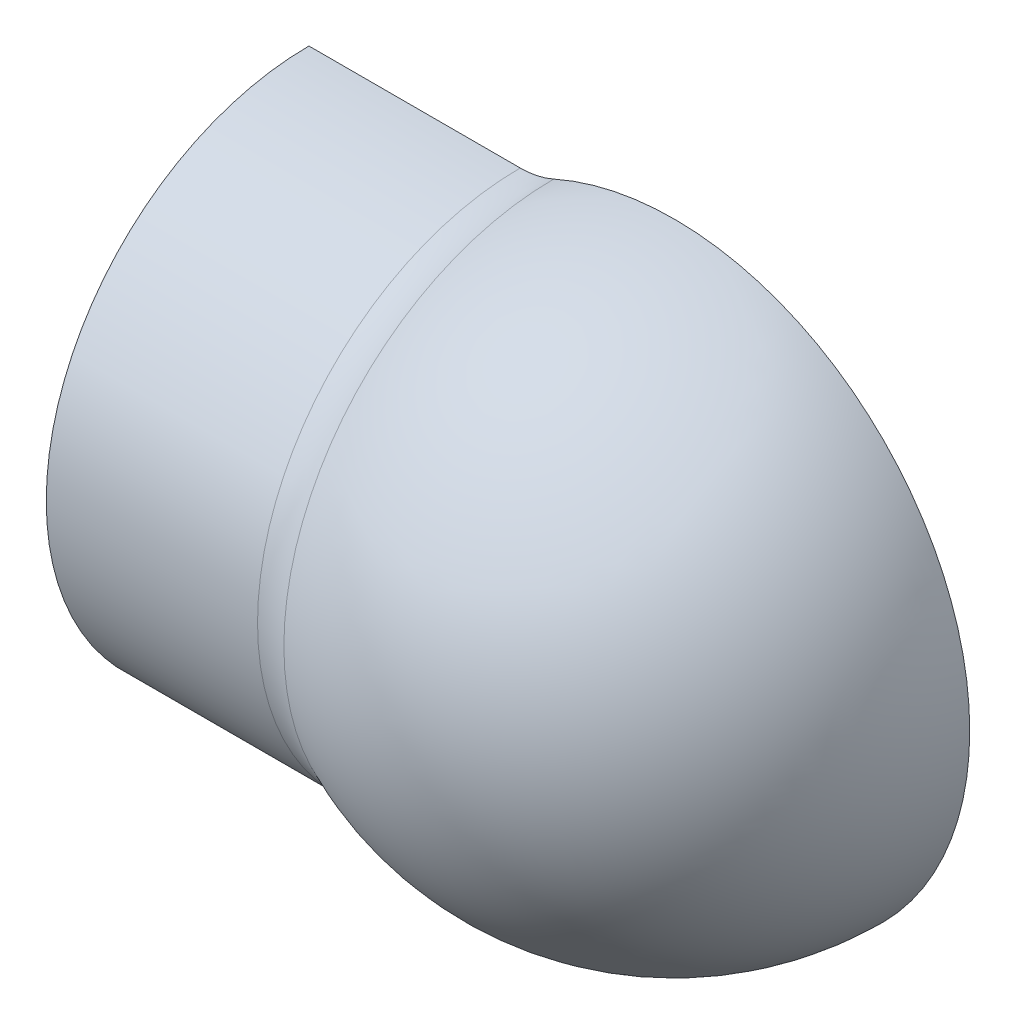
ISO-10303-21;
HEADER;
FILE_DESCRIPTION(('STEP AP214'),'2;1');
FILE_NAME('part.step','',(''),(''),'','','');
FILE_SCHEMA(('AUTOMOTIVE_DESIGN { 1 0 10303 214 1 1 1 1 }'));
ENDSEC;
DATA;
#1=APPLICATION_CONTEXT('core data for automotive mechanical design processes');
#2=APPLICATION_PROTOCOL_DEFINITION('international standard','automotive_design',2000,#1);
#3=PRODUCT_CONTEXT('',#1,'mechanical');
#4=PRODUCT('Part','Part','',(#3));
#5=PRODUCT_RELATED_PRODUCT_CATEGORY('part','',(#4));
#6=PRODUCT_DEFINITION_FORMATION('','',#4);
#7=PRODUCT_DEFINITION_CONTEXT('part definition',#1,'design');
#8=PRODUCT_DEFINITION('design','',#6,#7);
#9=PRODUCT_DEFINITION_SHAPE('','',#8);
#10=(LENGTH_UNIT() NAMED_UNIT(*) SI_UNIT(.MILLI.,.METRE.));
#11=(NAMED_UNIT(*) PLANE_ANGLE_UNIT() SI_UNIT($,.RADIAN.));
#12=(NAMED_UNIT(*) SI_UNIT($,.STERADIAN.) SOLID_ANGLE_UNIT());
#13=UNCERTAINTY_MEASURE_WITH_UNIT(LENGTH_MEASURE(1.E-05),#10,'distance_accuracy_value','');
#14=(GEOMETRIC_REPRESENTATION_CONTEXT(3) GLOBAL_UNCERTAINTY_ASSIGNED_CONTEXT((#13)) GLOBAL_UNIT_ASSIGNED_CONTEXT((#10,
#11,#12)) REPRESENTATION_CONTEXT('',''));
#15=CARTESIAN_POINT('',(0.,0.,0.));
#16=DIRECTION('',(0.,0.,1.));
#17=DIRECTION('',(1.,0.,0.));
#18=AXIS2_PLACEMENT_3D('',#15,#16,#17);
#19=CARTESIAN_POINT('',(0.,0.,0.));
#20=DIRECTION('',(-1.,0.,0.));
#21=DIRECTION('',(0.,-1.,0.));
#22=AXIS2_PLACEMENT_3D('',#19,#20,#21);
#23=SPHERICAL_SURFACE('',#22,36.);
#24=CARTESIAN_POINT('',(0.,0.,0.));
#25=DIRECTION('',(0.,0.,-1.));
#26=DIRECTION('',(1.,0.,0.));
#27=AXIS2_PLACEMENT_3D('',#24,#25,#26);
#28=CIRCLE('',#27,36.);
#29=CARTESIAN_POINT('',(-14.6830406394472,32.8695652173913,9.00989832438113E-13));
#30=VERTEX_POINT('',#29);
#31=CARTESIAN_POINT('',(-14.6830406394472,-32.8695652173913,-9.00989832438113E-13));
#32=VERTEX_POINT('',#31);
#33=EDGE_CURVE('E104',#30,#32,#28,.T.);
#34=ORIENTED_EDGE('',*,*,#33,.F.);
#35=CARTESIAN_POINT('',(-14.6830406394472,0.,0.));
#36=DIRECTION('',(1.,0.,0.));
#37=DIRECTION('',(0.,0.,-1.));
#38=AXIS2_PLACEMENT_3D('',#35,#36,#37);
#39=CIRCLE('',#38,32.8695652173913);
#40=EDGE_CURVE('E52',#30,#32,#39,.T.);
#41=ORIENTED_EDGE('',*,*,#40,.T.);
#42=EDGE_LOOP('',(#34,#41));
#43=FACE_BOUND('',#42,.T.);
#44=ADVANCED_FACE('F31',(#43),#23,.T.);
#45=CARTESIAN_POINT('',(-44.5,0.,0.));
#46=DIRECTION('',(-1.,0.,0.));
#47=DIRECTION('',(0.,0.,1.));
#48=AXIS2_PLACEMENT_3D('',#45,#46,#47);
#49=CYLINDRICAL_SURFACE('',#48,32.);
#50=DIRECTION('',(-1.,0.,0.));
#51=VECTOR('',#50,1.);
#52=CARTESIAN_POINT('',(-44.5,-32.,-8.77154122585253E-13));
#53=LINE('',#52,#51);
#54=CARTESIAN_POINT('',(-18.7616630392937,-32.,-8.77154122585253E-13));
#55=VERTEX_POINT('',#54);
#56=CARTESIAN_POINT('',(-44.5,-32.,-8.77154122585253E-13));
#57=VERTEX_POINT('',#56);
#58=EDGE_CURVE('E116',#55,#57,#53,.T.);
#59=ORIENTED_EDGE('',*,*,#58,.F.);
#60=CARTESIAN_POINT('',(-18.7616630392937,0.,0.));
#61=DIRECTION('',(1.,0.,0.));
#62=DIRECTION('',(0.,0.,-1.));
#63=AXIS2_PLACEMENT_3D('',#60,#61,#62);
#64=CIRCLE('',#63,32.);
#65=CARTESIAN_POINT('',(-18.7616630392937,32.,0.));
#66=VERTEX_POINT('',#65);
#67=EDGE_CURVE('E124',#55,#66,#64,.F.);
#68=ORIENTED_EDGE('',*,*,#67,.T.);
#69=DIRECTION('',(-1.,0.,0.));
#70=VECTOR('',#69,1.);
#71=CARTESIAN_POINT('',(-44.5,32.,0.));
#72=LINE('',#71,#70);
#73=CARTESIAN_POINT('',(-44.5,32.,0.));
#74=VERTEX_POINT('',#73);
#75=EDGE_CURVE('E102',#66,#74,#72,.T.);
#76=ORIENTED_EDGE('',*,*,#75,.T.);
#77=CARTESIAN_POINT('',(-44.5,0.,0.));
#78=DIRECTION('',(-1.,0.,0.));
#79=DIRECTION('',(0.,0.,1.));
#80=AXIS2_PLACEMENT_3D('',#77,#78,#79);
#81=CIRCLE('',#80,32.);
#82=EDGE_CURVE('E121',#57,#74,#81,.T.);
#83=ORIENTED_EDGE('',*,*,#82,.F.);
#84=EDGE_LOOP('',(#59,#68,#76,#83));
#85=FACE_BOUND('',#84,.T.);
#86=ADVANCED_FACE('F135',(#85),#49,.T.);
#87=CARTESIAN_POINT('',(-44.5,0.,0.));
#88=DIRECTION('',(1.,0.,0.));
#89=DIRECTION('',(0.,0.,-1.));
#90=AXIS2_PLACEMENT_3D('',#87,#88,#89);
#91=PLANE('',#90);
#92=DIRECTION('',(0.,1.,0.));
#93=VECTOR('',#92,1.);
#94=CARTESIAN_POINT('',(-44.5,0.,0.));
#95=LINE('',#94,#93);
#96=EDGE_CURVE('E118',#57,#74,#95,.T.);
#97=ORIENTED_EDGE('',*,*,#96,.F.);
#98=ORIENTED_EDGE('',*,*,#82,.T.);
#99=EDGE_LOOP('',(#97,#98));
#100=FACE_BOUND('',#99,.T.);
#101=ADVANCED_FACE('F138',(#100),#91,.F.);
#102=CARTESIAN_POINT('',(0.,0.,0.));
#103=DIRECTION('',(0.,0.,-1.));
#104=DIRECTION('',(1.,0.,0.));
#105=AXIS2_PLACEMENT_3D('',#102,#103,#104);
#106=PLANE('',#105);
#107=DIRECTION('',(0.,1.,0.));
#108=VECTOR('',#107,1.);
#109=CARTESIAN_POINT('',(-41.5,0.,0.));
#110=LINE('',#109,#108);
#111=CARTESIAN_POINT('',(-41.5,-29.,-7.94920923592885E-13));
#112=VERTEX_POINT('',#111);
#113=CARTESIAN_POINT('',(-41.5,29.,7.94920923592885E-13));
#114=VERTEX_POINT('',#113);
#115=EDGE_CURVE('E110',#112,#114,#110,.T.);
#116=ORIENTED_EDGE('',*,*,#115,.F.);
#117=DIRECTION('',(-1.,0.,0.));
#118=VECTOR('',#117,1.);
#119=CARTESIAN_POINT('',(-18.7616630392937,-29.,-8.03799612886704E-13));
#120=LINE('',#119,#118);
#121=CARTESIAN_POINT('',(-18.7616630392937,-29.,-8.03799612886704E-13));
#122=VERTEX_POINT('',#121);
#123=EDGE_CURVE('E96',#122,#112,#120,.T.);
#124=ORIENTED_EDGE('',*,*,#123,.F.);
#125=CARTESIAN_POINT('',(-18.7616630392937,-42.,-1.15126478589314E-12));
#126=DIRECTION('',(0.,0.,-1.));
#127=DIRECTION('',(0.,1.,0.));
#128=AXIS2_PLACEMENT_3D('',#125,#126,#127);
#129=CIRCLE('',#128,13.);
#130=CARTESIAN_POINT('',(-13.4594539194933,-30.1304347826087,-8.25907346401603E-13));
#131=VERTEX_POINT('',#130);
#132=EDGE_CURVE('E86',#131,#122,#129,.F.);
#133=ORIENTED_EDGE('',*,*,#132,.F.);
#134=CARTESIAN_POINT('',(0.,0.,0.));
#135=DIRECTION('',(0.,0.,-1.));
#136=DIRECTION('',(0.,1.,0.));
#137=AXIS2_PLACEMENT_3D('',#134,#135,#136);
#138=CIRCLE('',#137,33.);
#139=CARTESIAN_POINT('',(-13.4594539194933,30.1304347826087,8.29597260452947E-13));
#140=VERTEX_POINT('',#139);
#141=EDGE_CURVE('E93',#140,#131,#138,.T.);
#142=ORIENTED_EDGE('',*,*,#141,.F.);
#143=CARTESIAN_POINT('',(-18.7616630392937,42.,1.15126478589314E-12));
#144=DIRECTION('',(0.,0.,-1.));
#145=DIRECTION('',(0.,1.,0.));
#146=AXIS2_PLACEMENT_3D('',#143,#144,#145);
#147=CIRCLE('',#146,13.);
#148=CARTESIAN_POINT('',(-18.7616630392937,29.,0.));
#149=VERTEX_POINT('',#148);
#150=EDGE_CURVE('E89',#149,#140,#147,.F.);
#151=ORIENTED_EDGE('',*,*,#150,.F.);
#152=DIRECTION('',(-1.,0.,0.));
#153=VECTOR('',#152,1.);
#154=CARTESIAN_POINT('',(-18.7616630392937,29.,0.));
#155=LINE('',#154,#153);
#156=EDGE_CURVE('E97',#149,#114,#155,.T.);
#157=ORIENTED_EDGE('',*,*,#156,.T.);
#158=EDGE_LOOP('',(#116,#124,#133,#142,#151,#157));
#159=FACE_BOUND('',#158,.T.);
#160=ORIENTED_EDGE('',*,*,#96,.T.);
#161=ORIENTED_EDGE('',*,*,#75,.F.);
#162=CARTESIAN_POINT('',(-18.7616630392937,42.,1.15126478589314E-12));
#163=DIRECTION('',(0.,0.,-1.));
#164=DIRECTION('',(0.,1.,0.));
#165=AXIS2_PLACEMENT_3D('',#162,#163,#164);
#166=CIRCLE('',#165,10.);
#167=EDGE_CURVE('E38',#66,#30,#166,.F.);
#168=ORIENTED_EDGE('',*,*,#167,.T.);
#169=ORIENTED_EDGE('',*,*,#33,.T.);
#170=CARTESIAN_POINT('',(-18.7616630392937,-42.,-1.15126478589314E-12));
#171=DIRECTION('',(0.,0.,-1.));
#172=DIRECTION('',(0.,1.,0.));
#173=AXIS2_PLACEMENT_3D('',#170,#171,#172);
#174=CIRCLE('',#173,10.);
#175=EDGE_CURVE('E11',#32,#55,#174,.F.);
#176=ORIENTED_EDGE('',*,*,#175,.T.);
#177=ORIENTED_EDGE('',*,*,#58,.T.);
#178=EDGE_LOOP('',(#160,#161,#168,#169,#176,#177));
#179=FACE_BOUND('',#178,.T.);
#180=ADVANCED_FACE('F100',(#159,#179),#106,.T.);
#181=CARTESIAN_POINT('',(-18.7616630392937,0.,0.));
#182=DIRECTION('',(1.,0.,0.));
#183=DIRECTION('',(0.,0.,-1.));
#184=AXIS2_PLACEMENT_3D('',#181,#182,#183);
#185=TOROIDAL_SURFACE('',#184,42.,10.);
#186=ORIENTED_EDGE('',*,*,#175,.F.);
#187=ORIENTED_EDGE('',*,*,#40,.F.);
#188=ORIENTED_EDGE('',*,*,#167,.F.);
#189=ORIENTED_EDGE('',*,*,#67,.F.);
#190=EDGE_LOOP('',(#186,#187,#188,#189));
#191=FACE_BOUND('',#190,.T.);
#192=ADVANCED_FACE('F131',(#191),#185,.F.);
#193=CARTESIAN_POINT('',(0.,0.,0.));
#194=DIRECTION('',(-1.,0.,0.));
#195=DIRECTION('',(0.,-1.,0.));
#196=AXIS2_PLACEMENT_3D('',#193,#194,#195);
#197=SPHERICAL_SURFACE('',#196,33.);
#198=ORIENTED_EDGE('',*,*,#141,.T.);
#199=CARTESIAN_POINT('',(-13.4594539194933,0.,0.));
#200=DIRECTION('',(-1.,0.,0.));
#201=DIRECTION('',(0.,0.,1.));
#202=AXIS2_PLACEMENT_3D('',#199,#200,#201);
#203=CIRCLE('',#202,30.1304347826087);
#204=EDGE_CURVE('E82',#140,#131,#203,.F.);
#205=ORIENTED_EDGE('',*,*,#204,.F.);
#206=EDGE_LOOP('',(#198,#205));
#207=FACE_BOUND('',#206,.T.);
#208=ADVANCED_FACE('F94',(#207),#197,.F.);
#209=CARTESIAN_POINT('',(-44.5,0.,0.));
#210=DIRECTION('',(-1.,0.,0.));
#211=DIRECTION('',(0.,0.,1.));
#212=AXIS2_PLACEMENT_3D('',#209,#210,#211);
#213=CYLINDRICAL_SURFACE('',#212,29.);
#214=ORIENTED_EDGE('',*,*,#123,.T.);
#215=CARTESIAN_POINT('',(-41.5,0.,0.));
#216=DIRECTION('',(1.,0.,0.));
#217=DIRECTION('',(0.,0.,-1.));
#218=AXIS2_PLACEMENT_3D('',#215,#216,#217);
#219=CIRCLE('',#218,29.);
#220=EDGE_CURVE('E112',#112,#114,#219,.F.);
#221=ORIENTED_EDGE('',*,*,#220,.T.);
#222=ORIENTED_EDGE('',*,*,#156,.F.);
#223=CARTESIAN_POINT('',(-18.7616630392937,0.,0.));
#224=DIRECTION('',(-1.,0.,0.));
#225=DIRECTION('',(0.,0.,1.));
#226=AXIS2_PLACEMENT_3D('',#223,#224,#225);
#227=CIRCLE('',#226,29.);
#228=EDGE_CURVE('E45',#122,#149,#227,.T.);
#229=ORIENTED_EDGE('',*,*,#228,.F.);
#230=EDGE_LOOP('',(#214,#221,#222,#229));
#231=FACE_BOUND('',#230,.T.);
#232=ADVANCED_FACE('F178',(#231),#213,.F.);
#233=CARTESIAN_POINT('',(-41.5,0.,0.));
#234=DIRECTION('',(1.,0.,0.));
#235=DIRECTION('',(0.,0.,-1.));
#236=AXIS2_PLACEMENT_3D('',#233,#234,#235);
#237=PLANE('',#236);
#238=ORIENTED_EDGE('',*,*,#115,.T.);
#239=ORIENTED_EDGE('',*,*,#220,.F.);
#240=EDGE_LOOP('',(#238,#239));
#241=FACE_BOUND('',#240,.T.);
#242=ADVANCED_FACE('F187',(#241),#237,.T.);
#243=CARTESIAN_POINT('',(-18.7616630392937,0.,0.));
#244=DIRECTION('',(1.,0.,0.));
#245=DIRECTION('',(0.,0.,-1.));
#246=AXIS2_PLACEMENT_3D('',#243,#244,#245);
#247=TOROIDAL_SURFACE('',#246,42.,13.);
#248=ORIENTED_EDGE('',*,*,#132,.T.);
#249=ORIENTED_EDGE('',*,*,#228,.T.);
#250=ORIENTED_EDGE('',*,*,#150,.T.);
#251=ORIENTED_EDGE('',*,*,#204,.T.);
#252=EDGE_LOOP('',(#248,#249,#250,#251));
#253=FACE_BOUND('',#252,.T.);
#254=ADVANCED_FACE('F84',(#253),#247,.T.);
#255=CLOSED_SHELL('',(#44,#86,#101,#180,#192,#208,#232,#242,#254));
#256=MANIFOLD_SOLID_BREP('B2',#255);
#257=ADVANCED_BREP_SHAPE_REPRESENTATION('',(#18,#256),#14);
#258=SHAPE_DEFINITION_REPRESENTATION(#9,#257);
ENDSEC;
END-ISO-10303-21;
